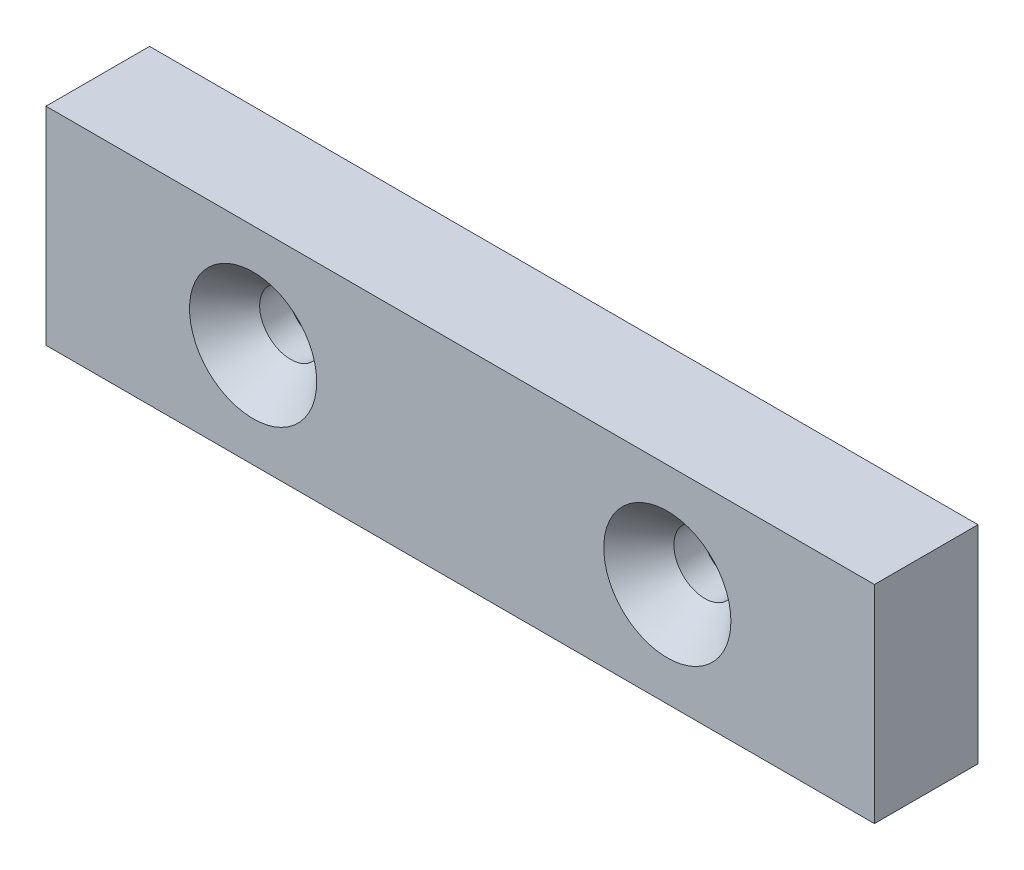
from build123d import *

# Parameters (mm, degrees)
BOSS_EXTRUDE1_DEPTH                               = 3.175
BOSS_EXTRUDE1_DEPTH_BACK                          = 3.175
SKETCH1_W                                         = 50.8
SKETCH1_H                                         = 12.7
CSK_FOR_6_FLAT_HEAD_SOCKET_CAP_SCREW1_D           = 3.7973
CSK_FOR_6_FLAT_HEAD_SOCKET_CAP_SCREW1_CSINK_D     = 7.7978
CSK_FOR_6_FLAT_HEAD_SOCKET_CAP_SCREW1_CSINK_ANGLE = 82


with BuildPart() as part:
    # Sketch1 → Boss-Extrude1 (new, two sides: drawn at the far end of the back side and taken through both)
    with BuildSketch(Plane.XY.offset(-BOSS_EXTRUDE1_DEPTH_BACK)):
        Rectangle(SKETCH1_W, SKETCH1_H)
    extrude(amount=BOSS_EXTRUDE1_DEPTH + BOSS_EXTRUDE1_DEPTH_BACK)

    # CSK for _6 Flat Head Socket Cap Screw1 (through all)
    with Locations(Plane.XY.offset(3.175)):
        with Locations((-12.7, 0), (12.7, 0)):
            csk_for_6_flat_head_socket_cap_screw1 = CounterSinkHole(CSK_FOR_6_FLAT_HEAD_SOCKET_CAP_SCREW1_D / 2, CSK_FOR_6_FLAT_HEAD_SOCKET_CAP_SCREW1_CSINK_D / 2, counter_sink_angle=CSK_FOR_6_FLAT_HEAD_SOCKET_CAP_SCREW1_CSINK_ANGLE)

    # Mirror1: CSK for _6 Flat Head Socket Cap Screw1 across plane
    add(csk_for_6_flat_head_socket_cap_screw1.mirror(Plane.XY), mode=Mode.SUBTRACT)


solid = part.part
